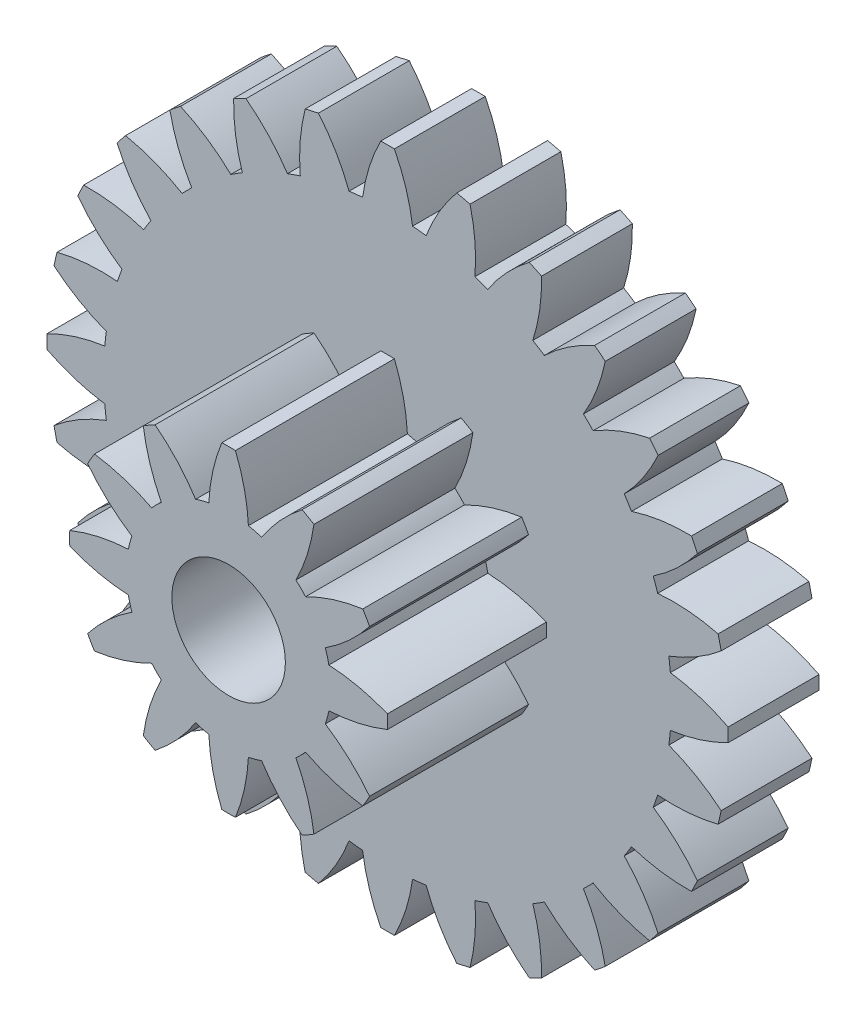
from build123d import *

# Parameters (mm, degrees)
ESQUISSE1_R                  = 7.5
BASE_EXTRUSION_DEPTH         = 2
ESQUISSE2_R                  = 3.5
BOSS_EXTRU_1_DEPTH           = 3.5
ENL_V_START                  = -3.5
ENL_V_MAT_EXTRU_1_DEPTH      = 3.5
R_P_TITION_CIRCULAIRE1_COUNT = 12
ENL_V_MAT_EXTRU_2_DEPTH      = 12.169153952
R_P_TITION_CIRCULAIRE2_COUNT = 28
ESQUISSE5_R                  = 1.25
ENL_V_MAT_EXTRU_3_DEPTH      = 12.947803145


with BuildPart() as part:
    # Esquisse1 → Base-Extrusion (new body)
    with BuildSketch(Plane.XY):
        Circle(ESQUISSE1_R)
    extrude(amount=BASE_EXTRUSION_DEPTH)

    # Esquisse2 → Boss.-Extru.1 (add)
    with BuildSketch(Plane.XY.offset(2)):
        Circle(ESQUISSE2_R)
    extrude(amount=BOSS_EXTRU_1_DEPTH)

    # Esquisse3 → Enl_v. mat.-Extru.1 (cut)
    with BuildSketch(Plane.XY.offset(5.5).offset(ENL_V_START)):
        with BuildLine():
            Line((0.582342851, 2.173333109), (1.08873197, 4.063203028))
            Line((1.08873197, 4.063203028), (-1.08873197, 4.063203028))
            Line((-1.08873197, 4.063203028), (-0.582342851, 2.173333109))
            ThreePointArc((-0.582342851, 2.173333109), (-0.509534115, 2.191546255), (-0.436158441, 2.207320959))
            ThreePointArc((-0.436158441, 2.207320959), (-0.346670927, 2.8639457), (-0.15, 3.496784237))
            ThreePointArc((-0.15, 3.496784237), (0, 3.5), (0.15, 3.496784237))
            ThreePointArc((0.15, 3.496784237), (0.346670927, 2.8639457), (0.436158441, 2.207320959))
            ThreePointArc((0.436158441, 2.207320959), (0.509534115, 2.191546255), (0.582342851, 2.173333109))
        make_face()
    enl_v_mat_extru_1 = extrude(amount=ENL_V_MAT_EXTRU_1_DEPTH, mode=Mode.SUBTRACT)

    # R_p_tition circulaire1: Enl_v. mat.-Extru.1 ×12 about axis
    r_p_tition_circulaire1_axis = Axis((0, 0, 0), (0, 0, 1))
    for i in range(1, R_P_TITION_CIRCULAIRE1_COUNT):
        add(enl_v_mat_extru_1.rotate(r_p_tition_circulaire1_axis, i * 360 / R_P_TITION_CIRCULAIRE1_COUNT), mode=Mode.SUBTRACT)

    # Esquisse4 → Enl_v. mat.-Extru.2 (cut, through all)
    with BuildSketch(Plane.XY.offset(2)):
        with BuildLine():
            Line((0.699777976, 6.210701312), (0.966987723, 8.582253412))
            Line((0.966987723, 8.582253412), (-0.966987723, 8.582253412))
            Line((-0.966987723, 8.582253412), (-0.699777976, 6.210701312))
            ThreePointArc((-0.699777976, 6.210701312), (-0.625193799, 6.218652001), (-0.550519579, 6.225707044))
            ThreePointArc((-0.550519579, 6.225707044), (-0.403706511, 6.878921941), (-0.15, 7.49849985))
            ThreePointArc((-0.15, 7.49849985), (0, 7.5), (0.15, 7.49849985))
            ThreePointArc((0.15, 7.49849985), (0.403706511, 6.878921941), (0.550519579, 6.225707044))
            ThreePointArc((0.550519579, 6.225707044), (0.625193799, 6.218652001), (0.699777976, 6.210701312))
        make_face()
    enl_v_mat_extru_2 = extrude(amount=-ENL_V_MAT_EXTRU_2_DEPTH, mode=Mode.SUBTRACT)

    # R_p_tition circulaire2: Enl_v. mat.-Extru.2 ×28 about axis
    r_p_tition_circulaire2_axis = Axis((0, 0, 0), (0, 0, 1))
    for i in range(1, R_P_TITION_CIRCULAIRE2_COUNT):
        add(enl_v_mat_extru_2.rotate(r_p_tition_circulaire2_axis, i * 360 / R_P_TITION_CIRCULAIRE2_COUNT), mode=Mode.SUBTRACT)

    # Esquisse5 → Enl_v. mat.-Extru.3 (cut, through all)
    with BuildSketch(Plane.XY.offset(5.5)):
        Circle(ESQUISSE5_R)
    extrude(amount=-ENL_V_MAT_EXTRU_3_DEPTH, mode=Mode.SUBTRACT)


solid = part.part
